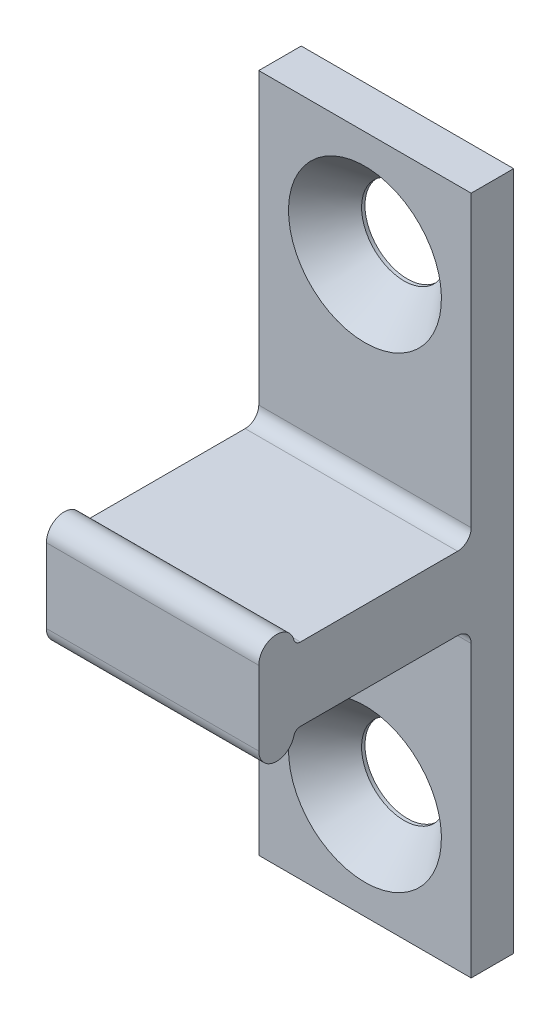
ISO-10303-21;
HEADER;
FILE_DESCRIPTION(('STEP AP214'),'2;1');
FILE_NAME('part.step','',(''),(''),'','','');
FILE_SCHEMA(('AUTOMOTIVE_DESIGN { 1 0 10303 214 1 1 1 1 }'));
ENDSEC;
DATA;
#1=APPLICATION_CONTEXT('core data for automotive mechanical design processes');
#2=APPLICATION_PROTOCOL_DEFINITION('international standard','automotive_design',2000,#1);
#3=PRODUCT_CONTEXT('',#1,'mechanical');
#4=PRODUCT('Part','Part','',(#3));
#5=PRODUCT_RELATED_PRODUCT_CATEGORY('part','',(#4));
#6=PRODUCT_DEFINITION_FORMATION('','',#4);
#7=PRODUCT_DEFINITION_CONTEXT('part definition',#1,'design');
#8=PRODUCT_DEFINITION('design','',#6,#7);
#9=PRODUCT_DEFINITION_SHAPE('','',#8);
#10=(LENGTH_UNIT() NAMED_UNIT(*) SI_UNIT(.MILLI.,.METRE.));
#11=(NAMED_UNIT(*) PLANE_ANGLE_UNIT() SI_UNIT($,.RADIAN.));
#12=(NAMED_UNIT(*) SI_UNIT($,.STERADIAN.) SOLID_ANGLE_UNIT());
#13=UNCERTAINTY_MEASURE_WITH_UNIT(LENGTH_MEASURE(1.E-05),#10,'distance_accuracy_value','');
#14=(GEOMETRIC_REPRESENTATION_CONTEXT(3) GLOBAL_UNCERTAINTY_ASSIGNED_CONTEXT((#13)) GLOBAL_UNIT_ASSIGNED_CONTEXT((#10,
#11,#12)) REPRESENTATION_CONTEXT('',''));
#15=CARTESIAN_POINT('',(0.,0.,0.));
#16=DIRECTION('',(0.,0.,1.));
#17=DIRECTION('',(1.,0.,0.));
#18=AXIS2_PLACEMENT_3D('',#15,#16,#17);
#19=CARTESIAN_POINT('',(3.96875,-1.87325000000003,2.0955));
#20=DIRECTION('',(-1.,0.,0.));
#21=DIRECTION('',(0.,0.,1.));
#22=AXIS2_PLACEMENT_3D('',#19,#20,#21);
#23=CYLINDRICAL_SURFACE('',#22,0.508);
#24=CARTESIAN_POINT('',(-3.96875,-1.87325000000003,2.0955));
#25=DIRECTION('',(1.,0.,0.));
#26=DIRECTION('',(0.,0.,-1.));
#27=AXIS2_PLACEMENT_3D('',#24,#25,#26);
#28=CIRCLE('',#27,0.508);
#29=CARTESIAN_POINT('',(-3.96875,-1.36525000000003,2.0955));
#30=VERTEX_POINT('',#29);
#31=CARTESIAN_POINT('',(-3.96875,-1.87325000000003,1.5875));
#32=VERTEX_POINT('',#31);
#33=EDGE_CURVE('E166',#30,#32,#28,.F.);
#34=ORIENTED_EDGE('',*,*,#33,.T.);
#35=DIRECTION('',(-1.,0.,0.));
#36=VECTOR('',#35,1.);
#37=CARTESIAN_POINT('',(3.96875,-1.87325000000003,1.5875));
#38=LINE('',#37,#36);
#39=CARTESIAN_POINT('',(3.96875,-1.87325000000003,1.5875));
#40=VERTEX_POINT('',#39);
#41=EDGE_CURVE('E11',#40,#32,#38,.T.);
#42=ORIENTED_EDGE('',*,*,#41,.F.);
#43=CARTESIAN_POINT('',(3.96875,-1.87325000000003,2.0955));
#44=DIRECTION('',(1.,0.,0.));
#45=DIRECTION('',(0.,0.,-1.));
#46=AXIS2_PLACEMENT_3D('',#43,#44,#45);
#47=CIRCLE('',#46,0.508);
#48=CARTESIAN_POINT('',(3.96875,-1.36525000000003,2.0955));
#49=VERTEX_POINT('',#48);
#50=EDGE_CURVE('E201',#49,#40,#47,.F.);
#51=ORIENTED_EDGE('',*,*,#50,.F.);
#52=DIRECTION('',(-1.,0.,0.));
#53=VECTOR('',#52,1.);
#54=CARTESIAN_POINT('',(3.96875,-1.36525000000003,2.0955));
#55=LINE('',#54,#53);
#56=EDGE_CURVE('E50',#49,#30,#55,.T.);
#57=ORIENTED_EDGE('',*,*,#56,.T.);
#58=EDGE_LOOP('',(#34,#42,#51,#57));
#59=FACE_BOUND('',#58,.T.);
#60=ADVANCED_FACE('F34',(#59),#23,.F.);
#61=CARTESIAN_POINT('',(3.96875,0.,1.5875));
#62=DIRECTION('',(0.,0.,-1.));
#63=DIRECTION('',(0.,1.,0.));
#64=AXIS2_PLACEMENT_3D('',#61,#62,#63);
#65=PLANE('',#64);
#66=CARTESIAN_POINT('',(0.,-8.73124999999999,1.58749999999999));
#67=DIRECTION('',(0.,0.,1.));
#68=DIRECTION('',(0.,-1.,0.));
#69=AXIS2_PLACEMENT_3D('',#66,#67,#68);
#70=CIRCLE('',#69,2.8575);
#71=CARTESIAN_POINT('',(0.,-11.58875,1.58749999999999));
#72=VERTEX_POINT('',#71);
#73=EDGE_CURVE('E291',#72,#72,#70,.T.);
#74=ORIENTED_EDGE('',*,*,#73,.F.);
#75=EDGE_LOOP('',(#74));
#76=FACE_BOUND('',#75,.T.);
#77=DIRECTION('',(0.,-1.,0.));
#78=VECTOR('',#77,1.);
#79=CARTESIAN_POINT('',(-3.96875,0.,1.5875));
#80=LINE('',#79,#78);
#81=CARTESIAN_POINT('',(-3.96875,-12.7,1.58749999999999));
#82=VERTEX_POINT('',#81);
#83=EDGE_CURVE('E168',#32,#82,#80,.T.);
#84=ORIENTED_EDGE('',*,*,#83,.T.);
#85=DIRECTION('',(-1.,0.,0.));
#86=VECTOR('',#85,1.);
#87=CARTESIAN_POINT('',(3.96875,-12.7,1.58749999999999));
#88=LINE('',#87,#86);
#89=CARTESIAN_POINT('',(3.96875,-12.7,1.58749999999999));
#90=VERTEX_POINT('',#89);
#91=EDGE_CURVE('E42',#90,#82,#88,.T.);
#92=ORIENTED_EDGE('',*,*,#91,.F.);
#93=DIRECTION('',(0.,-1.,0.));
#94=VECTOR('',#93,1.);
#95=CARTESIAN_POINT('',(3.96875,0.,1.5875));
#96=LINE('',#95,#94);
#97=EDGE_CURVE('E106',#40,#90,#96,.T.);
#98=ORIENTED_EDGE('',*,*,#97,.F.);
#99=ORIENTED_EDGE('',*,*,#41,.T.);
#100=EDGE_LOOP('',(#84,#92,#98,#99));
#101=FACE_BOUND('',#100,.T.);
#102=ADVANCED_FACE('F230',(#76,#101),#65,.F.);
#103=CARTESIAN_POINT('',(3.96875,-12.7,0.));
#104=DIRECTION('',(0.,-1.,0.));
#105=DIRECTION('',(0.,0.,-1.));
#106=AXIS2_PLACEMENT_3D('',#103,#104,#105);
#107=PLANE('',#106);
#108=DIRECTION('',(0.,0.,1.));
#109=VECTOR('',#108,1.);
#110=CARTESIAN_POINT('',(-3.96875,-12.7,0.));
#111=LINE('',#110,#109);
#112=CARTESIAN_POINT('',(-3.96875,-12.7,0.));
#113=VERTEX_POINT('',#112);
#114=EDGE_CURVE('E172',#113,#82,#111,.T.);
#115=ORIENTED_EDGE('',*,*,#114,.F.);
#116=DIRECTION('',(-1.,0.,0.));
#117=VECTOR('',#116,1.);
#118=CARTESIAN_POINT('',(3.96875,-12.7,0.));
#119=LINE('',#118,#117);
#120=CARTESIAN_POINT('',(3.96875,-12.7,0.));
#121=VERTEX_POINT('',#120);
#122=EDGE_CURVE('E223',#121,#113,#119,.T.);
#123=ORIENTED_EDGE('',*,*,#122,.F.);
#124=DIRECTION('',(0.,0.,1.));
#125=VECTOR('',#124,1.);
#126=CARTESIAN_POINT('',(3.96875,-12.7,0.));
#127=LINE('',#126,#125);
#128=EDGE_CURVE('E229',#121,#90,#127,.T.);
#129=ORIENTED_EDGE('',*,*,#128,.T.);
#130=ORIENTED_EDGE('',*,*,#91,.T.);
#131=EDGE_LOOP('',(#115,#123,#129,#130));
#132=FACE_BOUND('',#131,.T.);
#133=ADVANCED_FACE('F227',(#132),#107,.T.);
#134=CARTESIAN_POINT('',(3.96875,0.,0.));
#135=DIRECTION('',(0.,0.,-1.));
#136=DIRECTION('',(-1.,0.,0.));
#137=AXIS2_PLACEMENT_3D('',#134,#135,#136);
#138=PLANE('',#137);
#139=CARTESIAN_POINT('',(0.,8.73124999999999,0.));
#140=DIRECTION('',(0.,0.,1.));
#141=DIRECTION('',(0.,-1.,0.));
#142=AXIS2_PLACEMENT_3D('',#139,#140,#141);
#143=CIRCLE('',#142,1.5875);
#144=CARTESIAN_POINT('',(0.,7.14374999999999,0.));
#145=VERTEX_POINT('',#144);
#146=EDGE_CURVE('E294',#145,#145,#143,.T.);
#147=ORIENTED_EDGE('',*,*,#146,.T.);
#148=EDGE_LOOP('',(#147));
#149=FACE_BOUND('',#148,.T.);
#150=CARTESIAN_POINT('',(0.,-8.73124999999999,0.));
#151=DIRECTION('',(0.,0.,1.));
#152=DIRECTION('',(0.,-1.,0.));
#153=AXIS2_PLACEMENT_3D('',#150,#151,#152);
#154=CIRCLE('',#153,1.5875);
#155=CARTESIAN_POINT('',(0.,-10.31875,0.));
#156=VERTEX_POINT('',#155);
#157=EDGE_CURVE('E169',#156,#156,#154,.T.);
#158=ORIENTED_EDGE('',*,*,#157,.T.);
#159=EDGE_LOOP('',(#158));
#160=FACE_BOUND('',#159,.T.);
#161=DIRECTION('',(0.,-1.,0.));
#162=VECTOR('',#161,1.);
#163=CARTESIAN_POINT('',(-3.96875,0.,0.));
#164=LINE('',#163,#162);
#165=CARTESIAN_POINT('',(-3.96875,12.7,0.));
#166=VERTEX_POINT('',#165);
#167=EDGE_CURVE('E175',#166,#113,#164,.T.);
#168=ORIENTED_EDGE('',*,*,#167,.F.);
#169=DIRECTION('',(-1.,0.,0.));
#170=VECTOR('',#169,1.);
#171=CARTESIAN_POINT('',(3.96875,12.7,0.));
#172=LINE('',#171,#170);
#173=CARTESIAN_POINT('',(3.96875,12.7,0.));
#174=VERTEX_POINT('',#173);
#175=EDGE_CURVE('E221',#174,#166,#172,.T.);
#176=ORIENTED_EDGE('',*,*,#175,.F.);
#177=DIRECTION('',(0.,-1.,0.));
#178=VECTOR('',#177,1.);
#179=CARTESIAN_POINT('',(3.96875,0.,0.));
#180=LINE('',#179,#178);
#181=EDGE_CURVE('E242',#174,#121,#180,.T.);
#182=ORIENTED_EDGE('',*,*,#181,.T.);
#183=ORIENTED_EDGE('',*,*,#122,.T.);
#184=EDGE_LOOP('',(#168,#176,#182,#183));
#185=FACE_BOUND('',#184,.T.);
#186=ADVANCED_FACE('F238',(#149,#160,#185),#138,.T.);
#187=CARTESIAN_POINT('',(3.96875,12.7,0.));
#188=DIRECTION('',(0.,-1.,0.));
#189=DIRECTION('',(0.,0.,-1.));
#190=AXIS2_PLACEMENT_3D('',#187,#188,#189);
#191=PLANE('',#190);
#192=DIRECTION('',(0.,0.,1.));
#193=VECTOR('',#192,1.);
#194=CARTESIAN_POINT('',(-3.96875,12.7,0.));
#195=LINE('',#194,#193);
#196=CARTESIAN_POINT('',(-3.96875,12.7,1.58749999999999));
#197=VERTEX_POINT('',#196);
#198=EDGE_CURVE('E178',#166,#197,#195,.T.);
#199=ORIENTED_EDGE('',*,*,#198,.T.);
#200=DIRECTION('',(-1.,0.,0.));
#201=VECTOR('',#200,1.);
#202=CARTESIAN_POINT('',(3.96875,12.7,1.58749999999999));
#203=LINE('',#202,#201);
#204=CARTESIAN_POINT('',(3.96875,12.7,1.58749999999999));
#205=VERTEX_POINT('',#204);
#206=EDGE_CURVE('E218',#205,#197,#203,.T.);
#207=ORIENTED_EDGE('',*,*,#206,.F.);
#208=DIRECTION('',(0.,0.,1.));
#209=VECTOR('',#208,1.);
#210=CARTESIAN_POINT('',(3.96875,12.7,0.));
#211=LINE('',#210,#209);
#212=EDGE_CURVE('E244',#174,#205,#211,.T.);
#213=ORIENTED_EDGE('',*,*,#212,.F.);
#214=ORIENTED_EDGE('',*,*,#175,.T.);
#215=EDGE_LOOP('',(#199,#207,#213,#214));
#216=FACE_BOUND('',#215,.T.);
#217=ADVANCED_FACE('F310',(#216),#191,.F.);
#218=CARTESIAN_POINT('',(3.96875,0.,1.5875));
#219=DIRECTION('',(0.,0.,-1.));
#220=DIRECTION('',(0.,1.,0.));
#221=AXIS2_PLACEMENT_3D('',#218,#219,#220);
#222=PLANE('',#221);
#223=CARTESIAN_POINT('',(0.,8.73124999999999,1.58749999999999));
#224=DIRECTION('',(0.,0.,1.));
#225=DIRECTION('',(0.,-1.,0.));
#226=AXIS2_PLACEMENT_3D('',#223,#224,#225);
#227=CIRCLE('',#226,2.8575);
#228=CARTESIAN_POINT('',(0.,5.87374999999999,1.58749999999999));
#229=VERTEX_POINT('',#228);
#230=EDGE_CURVE('E300',#229,#229,#227,.T.);
#231=ORIENTED_EDGE('',*,*,#230,.F.);
#232=EDGE_LOOP('',(#231));
#233=FACE_BOUND('',#232,.T.);
#234=DIRECTION('',(0.,-1.,0.));
#235=VECTOR('',#234,1.);
#236=CARTESIAN_POINT('',(-3.96875,0.,1.5875));
#237=LINE('',#236,#235);
#238=CARTESIAN_POINT('',(-3.96875,1.87325000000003,1.5875));
#239=VERTEX_POINT('',#238);
#240=EDGE_CURVE('E180',#197,#239,#237,.T.);
#241=ORIENTED_EDGE('',*,*,#240,.T.);
#242=DIRECTION('',(-1.,0.,0.));
#243=VECTOR('',#242,1.);
#244=CARTESIAN_POINT('',(3.96875,1.87325000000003,1.5875));
#245=LINE('',#244,#243);
#246=CARTESIAN_POINT('',(3.96875,1.87325000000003,1.5875));
#247=VERTEX_POINT('',#246);
#248=EDGE_CURVE('E216',#247,#239,#245,.T.);
#249=ORIENTED_EDGE('',*,*,#248,.F.);
#250=DIRECTION('',(0.,-1.,0.));
#251=VECTOR('',#250,1.);
#252=CARTESIAN_POINT('',(3.96875,0.,1.5875));
#253=LINE('',#252,#251);
#254=EDGE_CURVE('E250',#205,#247,#253,.T.);
#255=ORIENTED_EDGE('',*,*,#254,.F.);
#256=ORIENTED_EDGE('',*,*,#206,.T.);
#257=EDGE_LOOP('',(#241,#249,#255,#256));
#258=FACE_BOUND('',#257,.T.);
#259=ADVANCED_FACE('F306',(#233,#258),#222,.F.);
#260=CARTESIAN_POINT('',(3.96875,1.87325000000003,2.0955));
#261=DIRECTION('',(-1.,0.,0.));
#262=DIRECTION('',(0.,0.,1.));
#263=AXIS2_PLACEMENT_3D('',#260,#261,#262);
#264=CYLINDRICAL_SURFACE('',#263,0.508);
#265=CARTESIAN_POINT('',(-3.96875,1.87325000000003,2.0955));
#266=DIRECTION('',(1.,0.,0.));
#267=DIRECTION('',(0.,0.,-1.));
#268=AXIS2_PLACEMENT_3D('',#265,#266,#267);
#269=CIRCLE('',#268,0.508);
#270=CARTESIAN_POINT('',(-3.96875,1.36525000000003,2.0955));
#271=VERTEX_POINT('',#270);
#272=EDGE_CURVE('E183',#271,#239,#269,.T.);
#273=ORIENTED_EDGE('',*,*,#272,.F.);
#274=DIRECTION('',(-1.,0.,0.));
#275=VECTOR('',#274,1.);
#276=CARTESIAN_POINT('',(3.96875,1.36525000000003,2.0955));
#277=LINE('',#276,#275);
#278=CARTESIAN_POINT('',(3.96875,1.36525000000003,2.0955));
#279=VERTEX_POINT('',#278);
#280=EDGE_CURVE('E214',#279,#271,#277,.T.);
#281=ORIENTED_EDGE('',*,*,#280,.F.);
#282=CARTESIAN_POINT('',(3.96875,1.87325000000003,2.0955));
#283=DIRECTION('',(1.,0.,0.));
#284=DIRECTION('',(0.,0.,-1.));
#285=AXIS2_PLACEMENT_3D('',#282,#283,#284);
#286=CIRCLE('',#285,0.508);
#287=EDGE_CURVE('E252',#279,#247,#286,.T.);
#288=ORIENTED_EDGE('',*,*,#287,.T.);
#289=ORIENTED_EDGE('',*,*,#248,.T.);
#290=EDGE_LOOP('',(#273,#281,#288,#289));
#291=FACE_BOUND('',#290,.T.);
#292=ADVANCED_FACE('F309',(#291),#264,.F.);
#293=CARTESIAN_POINT('',(3.96875,1.36525000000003,0.));
#294=DIRECTION('',(0.,-1.,0.));
#295=DIRECTION('',(0.,0.,-1.));
#296=AXIS2_PLACEMENT_3D('',#293,#294,#295);
#297=PLANE('',#296);
#298=DIRECTION('',(0.,0.,1.));
#299=VECTOR('',#298,1.);
#300=CARTESIAN_POINT('',(-3.96875,1.36525000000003,0.));
#301=LINE('',#300,#299);
#302=CARTESIAN_POINT('',(-3.96875,1.36525000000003,7.96697325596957));
#303=VERTEX_POINT('',#302);
#304=EDGE_CURVE('E186',#271,#303,#301,.T.);
#305=ORIENTED_EDGE('',*,*,#304,.T.);
#306=DIRECTION('',(-1.,0.,0.));
#307=VECTOR('',#306,1.);
#308=CARTESIAN_POINT('',(3.96875,1.36525000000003,7.96697325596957));
#309=LINE('',#308,#307);
#310=CARTESIAN_POINT('',(3.96875,1.36525000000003,7.96697325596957));
#311=VERTEX_POINT('',#310);
#312=EDGE_CURVE('E211',#311,#303,#309,.T.);
#313=ORIENTED_EDGE('',*,*,#312,.F.);
#314=DIRECTION('',(0.,0.,1.));
#315=VECTOR('',#314,1.);
#316=CARTESIAN_POINT('',(3.96875,1.36525000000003,0.));
#317=LINE('',#316,#315);
#318=EDGE_CURVE('E255',#279,#311,#317,.T.);
#319=ORIENTED_EDGE('',*,*,#318,.F.);
#320=ORIENTED_EDGE('',*,*,#280,.T.);
#321=EDGE_LOOP('',(#305,#313,#319,#320));
#322=FACE_BOUND('',#321,.T.);
#323=ADVANCED_FACE('F449',(#322),#297,.F.);
#324=CARTESIAN_POINT('',(3.96875,1.61925000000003,7.96697325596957));
#325=DIRECTION('',(-1.,0.,0.));
#326=DIRECTION('',(0.,0.,1.));
#327=AXIS2_PLACEMENT_3D('',#324,#325,#326);
#328=CYLINDRICAL_SURFACE('',#327,0.254);
#329=CARTESIAN_POINT('',(-3.96875,1.61925000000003,7.96697325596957));
#330=DIRECTION('',(1.,0.,0.));
#331=DIRECTION('',(0.,0.,-1.));
#332=AXIS2_PLACEMENT_3D('',#329,#330,#331);
#333=CIRCLE('',#332,0.254);
#334=CARTESIAN_POINT('',(-3.96875,1.55535463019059,8.2128052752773));
#335=VERTEX_POINT('',#334);
#336=EDGE_CURVE('E188',#303,#335,#333,.F.);
#337=ORIENTED_EDGE('',*,*,#336,.T.);
#338=DIRECTION('',(-1.,0.,0.));
#339=VECTOR('',#338,1.);
#340=CARTESIAN_POINT('',(3.96875,1.55535463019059,8.2128052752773));
#341=LINE('',#340,#339);
#342=CARTESIAN_POINT('',(3.96875,1.55535463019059,8.2128052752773));
#343=VERTEX_POINT('',#342);
#344=EDGE_CURVE('E208',#343,#335,#341,.T.);
#345=ORIENTED_EDGE('',*,*,#344,.F.);
#346=CARTESIAN_POINT('',(3.96875,1.61925000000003,7.96697325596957));
#347=DIRECTION('',(1.,0.,0.));
#348=DIRECTION('',(0.,0.,-1.));
#349=AXIS2_PLACEMENT_3D('',#346,#347,#348);
#350=CIRCLE('',#349,0.254);
#351=EDGE_CURVE('E257',#311,#343,#350,.F.);
#352=ORIENTED_EDGE('',*,*,#351,.F.);
#353=ORIENTED_EDGE('',*,*,#312,.T.);
#354=EDGE_LOOP('',(#337,#345,#352,#353));
#355=FACE_BOUND('',#354,.T.);
#356=ADVANCED_FACE('F440',(#355),#328,.F.);
#357=CARTESIAN_POINT('',(3.96875,1.38761194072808,8.85818105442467));
#358=DIRECTION('',(-1.,0.,0.));
#359=DIRECTION('',(0.,0.,1.));
#360=AXIS2_PLACEMENT_3D('',#357,#358,#359);
#361=CYLINDRICAL_SURFACE('',#360,0.66681894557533);
#362=CARTESIAN_POINT('',(-3.96875,1.38761194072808,8.85818105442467));
#363=DIRECTION('',(1.,0.,0.));
#364=DIRECTION('',(0.,0.,-1.));
#365=AXIS2_PLACEMENT_3D('',#362,#363,#364);
#366=CIRCLE('',#365,0.66681894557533);
#367=CARTESIAN_POINT('',(-3.96875,1.38761194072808,9.525));
#368=VERTEX_POINT('',#367);
#369=EDGE_CURVE('E190',#335,#368,#366,.T.);
#370=ORIENTED_EDGE('',*,*,#369,.T.);
#371=DIRECTION('',(-1.,0.,0.));
#372=VECTOR('',#371,1.);
#373=CARTESIAN_POINT('',(3.96875,1.38761194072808,9.525));
#374=LINE('',#373,#372);
#375=CARTESIAN_POINT('',(3.96875,1.38761194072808,9.525));
#376=VERTEX_POINT('',#375);
#377=EDGE_CURVE('E205',#376,#368,#374,.T.);
#378=ORIENTED_EDGE('',*,*,#377,.F.);
#379=CARTESIAN_POINT('',(3.96875,1.38761194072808,8.85818105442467));
#380=DIRECTION('',(1.,0.,0.));
#381=DIRECTION('',(0.,0.,-1.));
#382=AXIS2_PLACEMENT_3D('',#379,#380,#381);
#383=CIRCLE('',#382,0.66681894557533);
#384=EDGE_CURVE('E259',#343,#376,#383,.T.);
#385=ORIENTED_EDGE('',*,*,#384,.F.);
#386=ORIENTED_EDGE('',*,*,#344,.T.);
#387=EDGE_LOOP('',(#370,#378,#385,#386));
#388=FACE_BOUND('',#387,.T.);
#389=ADVANCED_FACE('F265',(#388),#361,.T.);
#390=CARTESIAN_POINT('',(3.96875,0.,9.525));
#391=DIRECTION('',(0.,0.,-1.));
#392=DIRECTION('',(-1.,0.,0.));
#393=AXIS2_PLACEMENT_3D('',#390,#391,#392);
#394=PLANE('',#393);
#395=DIRECTION('',(0.,-1.,0.));
#396=VECTOR('',#395,1.);
#397=CARTESIAN_POINT('',(-3.96875,0.,9.525));
#398=LINE('',#397,#396);
#399=CARTESIAN_POINT('',(-3.96875,-1.38761194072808,9.525));
#400=VERTEX_POINT('',#399);
#401=EDGE_CURVE('E192',#368,#400,#398,.T.);
#402=ORIENTED_EDGE('',*,*,#401,.T.);
#403=DIRECTION('',(-1.,0.,0.));
#404=VECTOR('',#403,1.);
#405=CARTESIAN_POINT('',(3.96875,-1.38761194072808,9.525));
#406=LINE('',#405,#404);
#407=CARTESIAN_POINT('',(3.96875,-1.38761194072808,9.525));
#408=VERTEX_POINT('',#407);
#409=EDGE_CURVE('E149',#408,#400,#406,.T.);
#410=ORIENTED_EDGE('',*,*,#409,.F.);
#411=DIRECTION('',(0.,-1.,0.));
#412=VECTOR('',#411,1.);
#413=CARTESIAN_POINT('',(3.96875,0.,9.525));
#414=LINE('',#413,#412);
#415=EDGE_CURVE('E157',#376,#408,#414,.T.);
#416=ORIENTED_EDGE('',*,*,#415,.F.);
#417=ORIENTED_EDGE('',*,*,#377,.T.);
#418=EDGE_LOOP('',(#402,#410,#416,#417));
#419=FACE_BOUND('',#418,.T.);
#420=ADVANCED_FACE('F269',(#419),#394,.F.);
#421=CARTESIAN_POINT('',(3.96875,-1.38761194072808,8.85818105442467));
#422=DIRECTION('',(-1.,0.,0.));
#423=DIRECTION('',(0.,0.,1.));
#424=AXIS2_PLACEMENT_3D('',#421,#422,#423);
#425=CYLINDRICAL_SURFACE('',#424,0.66681894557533);
#426=CARTESIAN_POINT('',(-3.96875,-1.38761194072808,8.85818105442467));
#427=DIRECTION('',(1.,0.,0.));
#428=DIRECTION('',(0.,0.,-1.));
#429=AXIS2_PLACEMENT_3D('',#426,#427,#428);
#430=CIRCLE('',#429,0.66681894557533);
#431=CARTESIAN_POINT('',(-3.96875,-1.55535463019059,8.2128052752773));
#432=VERTEX_POINT('',#431);
#433=EDGE_CURVE('E145',#432,#400,#430,.F.);
#434=ORIENTED_EDGE('',*,*,#433,.F.);
#435=DIRECTION('',(-1.,0.,0.));
#436=VECTOR('',#435,1.);
#437=CARTESIAN_POINT('',(3.96875,-1.55535463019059,8.2128052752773));
#438=LINE('',#437,#436);
#439=CARTESIAN_POINT('',(3.96875,-1.55535463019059,8.2128052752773));
#440=VERTEX_POINT('',#439);
#441=EDGE_CURVE('E140',#440,#432,#438,.T.);
#442=ORIENTED_EDGE('',*,*,#441,.F.);
#443=CARTESIAN_POINT('',(3.96875,-1.38761194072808,8.85818105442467));
#444=DIRECTION('',(1.,0.,0.));
#445=DIRECTION('',(0.,0.,-1.));
#446=AXIS2_PLACEMENT_3D('',#443,#444,#445);
#447=CIRCLE('',#446,0.66681894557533);
#448=EDGE_CURVE('E143',#440,#408,#447,.F.);
#449=ORIENTED_EDGE('',*,*,#448,.T.);
#450=ORIENTED_EDGE('',*,*,#409,.T.);
#451=EDGE_LOOP('',(#434,#442,#449,#450));
#452=FACE_BOUND('',#451,.T.);
#453=ADVANCED_FACE('F142',(#452),#425,.T.);
#454=CARTESIAN_POINT('',(3.96875,-1.61925000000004,7.96697325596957));
#455=DIRECTION('',(-1.,0.,0.));
#456=DIRECTION('',(0.,0.,1.));
#457=AXIS2_PLACEMENT_3D('',#454,#455,#456);
#458=CYLINDRICAL_SURFACE('',#457,0.254);
#459=CARTESIAN_POINT('',(-3.96875,-1.61925000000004,7.96697325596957));
#460=DIRECTION('',(1.,0.,0.));
#461=DIRECTION('',(0.,0.,-1.));
#462=AXIS2_PLACEMENT_3D('',#459,#460,#461);
#463=CIRCLE('',#462,0.254);
#464=CARTESIAN_POINT('',(-3.96875,-1.36525000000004,7.96697325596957));
#465=VERTEX_POINT('',#464);
#466=EDGE_CURVE('E196',#465,#432,#463,.T.);
#467=ORIENTED_EDGE('',*,*,#466,.F.);
#468=DIRECTION('',(-1.,0.,0.));
#469=VECTOR('',#468,1.);
#470=CARTESIAN_POINT('',(3.96875,-1.36525000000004,7.96697325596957));
#471=LINE('',#470,#469);
#472=CARTESIAN_POINT('',(3.96875,-1.36525000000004,7.96697325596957));
#473=VERTEX_POINT('',#472);
#474=EDGE_CURVE('E94',#473,#465,#471,.T.);
#475=ORIENTED_EDGE('',*,*,#474,.F.);
#476=CARTESIAN_POINT('',(3.96875,-1.61925000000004,7.96697325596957));
#477=DIRECTION('',(1.,0.,0.));
#478=DIRECTION('',(0.,0.,-1.));
#479=AXIS2_PLACEMENT_3D('',#476,#477,#478);
#480=CIRCLE('',#479,0.254);
#481=EDGE_CURVE('E155',#473,#440,#480,.T.);
#482=ORIENTED_EDGE('',*,*,#481,.T.);
#483=ORIENTED_EDGE('',*,*,#441,.T.);
#484=EDGE_LOOP('',(#467,#475,#482,#483));
#485=FACE_BOUND('',#484,.T.);
#486=ADVANCED_FACE('F160',(#485),#458,.F.);
#487=CARTESIAN_POINT('',(3.96875,-1.36525000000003,0.));
#488=DIRECTION('',(0.,-1.,0.));
#489=DIRECTION('',(0.,0.,-1.));
#490=AXIS2_PLACEMENT_3D('',#487,#488,#489);
#491=PLANE('',#490);
#492=DIRECTION('',(0.,0.,1.));
#493=VECTOR('',#492,1.);
#494=CARTESIAN_POINT('',(-3.96875,-1.36525000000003,0.));
#495=LINE('',#494,#493);
#496=EDGE_CURVE('E198',#30,#465,#495,.T.);
#497=ORIENTED_EDGE('',*,*,#496,.F.);
#498=ORIENTED_EDGE('',*,*,#56,.F.);
#499=DIRECTION('',(0.,0.,1.));
#500=VECTOR('',#499,1.);
#501=CARTESIAN_POINT('',(3.96875,-1.36525000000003,0.));
#502=LINE('',#501,#500);
#503=EDGE_CURVE('E161',#49,#473,#502,.T.);
#504=ORIENTED_EDGE('',*,*,#503,.T.);
#505=ORIENTED_EDGE('',*,*,#474,.T.);
#506=EDGE_LOOP('',(#497,#498,#504,#505));
#507=FACE_BOUND('',#506,.T.);
#508=ADVANCED_FACE('F270',(#507),#491,.T.);
#509=CARTESIAN_POINT('',(3.96875,0.,0.));
#510=DIRECTION('',(1.,0.,0.));
#511=DIRECTION('',(0.,0.,-1.));
#512=AXIS2_PLACEMENT_3D('',#509,#510,#511);
#513=PLANE('',#512);
#514=ORIENTED_EDGE('',*,*,#50,.T.);
#515=ORIENTED_EDGE('',*,*,#97,.T.);
#516=ORIENTED_EDGE('',*,*,#128,.F.);
#517=ORIENTED_EDGE('',*,*,#181,.F.);
#518=ORIENTED_EDGE('',*,*,#212,.T.);
#519=ORIENTED_EDGE('',*,*,#254,.T.);
#520=ORIENTED_EDGE('',*,*,#287,.F.);
#521=ORIENTED_EDGE('',*,*,#318,.T.);
#522=ORIENTED_EDGE('',*,*,#351,.T.);
#523=ORIENTED_EDGE('',*,*,#384,.T.);
#524=ORIENTED_EDGE('',*,*,#415,.T.);
#525=ORIENTED_EDGE('',*,*,#448,.F.);
#526=ORIENTED_EDGE('',*,*,#481,.F.);
#527=ORIENTED_EDGE('',*,*,#503,.F.);
#528=EDGE_LOOP('',(#514,#515,#516,#517,#518,#519,#520,#521,#522,#523,#524,#525,#526,#527));
#529=FACE_BOUND('',#528,.T.);
#530=ADVANCED_FACE('F153',(#529),#513,.T.);
#531=CARTESIAN_POINT('',(-3.96875,0.,0.));
#532=DIRECTION('',(1.,0.,0.));
#533=DIRECTION('',(0.,0.,-1.));
#534=AXIS2_PLACEMENT_3D('',#531,#532,#533);
#535=PLANE('',#534);
#536=ORIENTED_EDGE('',*,*,#33,.F.);
#537=ORIENTED_EDGE('',*,*,#496,.T.);
#538=ORIENTED_EDGE('',*,*,#466,.T.);
#539=ORIENTED_EDGE('',*,*,#433,.T.);
#540=ORIENTED_EDGE('',*,*,#401,.F.);
#541=ORIENTED_EDGE('',*,*,#369,.F.);
#542=ORIENTED_EDGE('',*,*,#336,.F.);
#543=ORIENTED_EDGE('',*,*,#304,.F.);
#544=ORIENTED_EDGE('',*,*,#272,.T.);
#545=ORIENTED_EDGE('',*,*,#240,.F.);
#546=ORIENTED_EDGE('',*,*,#198,.F.);
#547=ORIENTED_EDGE('',*,*,#167,.T.);
#548=ORIENTED_EDGE('',*,*,#114,.T.);
#549=ORIENTED_EDGE('',*,*,#83,.F.);
#550=EDGE_LOOP('',(#536,#537,#538,#539,#540,#541,#542,#543,#544,#545,#546,#547,#548,#549));
#551=FACE_BOUND('',#550,.T.);
#552=ADVANCED_FACE('F233',(#551),#535,.F.);
#553=CARTESIAN_POINT('',(0.,-8.73124999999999,1.58749999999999));
#554=DIRECTION('',(0.,0.,1.));
#555=DIRECTION('',(0.,-1.,0.));
#556=AXIS2_PLACEMENT_3D('',#553,#554,#555);
#557=CYLINDRICAL_SURFACE('',#556,1.5875);
#558=ORIENTED_EDGE('',*,*,#157,.F.);
#559=EDGE_LOOP('',(#558));
#560=FACE_BOUND('',#559,.T.);
#561=CARTESIAN_POINT('',(0.,-8.73124999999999,0.126532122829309));
#562=DIRECTION('',(0.,0.,1.));
#563=DIRECTION('',(0.,-1.,0.));
#564=AXIS2_PLACEMENT_3D('',#561,#562,#563);
#565=CIRCLE('',#564,1.5875);
#566=CARTESIAN_POINT('',(0.,-10.31875,0.126532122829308));
#567=VERTEX_POINT('',#566);
#568=EDGE_CURVE('E288',#567,#567,#565,.T.);
#569=ORIENTED_EDGE('',*,*,#568,.T.);
#570=EDGE_LOOP('',(#569));
#571=FACE_BOUND('',#570,.T.);
#572=ADVANCED_FACE('F358',(#560,#571),#557,.F.);
#573=CARTESIAN_POINT('',(0.,-8.73124999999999,1.58749999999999));
#574=DIRECTION('',(0.,0.,1.));
#575=DIRECTION('',(0.,-1.,0.));
#576=AXIS2_PLACEMENT_3D('',#573,#574,#575);
#577=CONICAL_SURFACE('',#576,2.8575,0.715584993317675);
#578=ORIENTED_EDGE('',*,*,#568,.F.);
#579=EDGE_LOOP('',(#578));
#580=FACE_BOUND('',#579,.T.);
#581=ORIENTED_EDGE('',*,*,#73,.T.);
#582=EDGE_LOOP('',(#581));
#583=FACE_BOUND('',#582,.T.);
#584=ADVANCED_FACE('F363',(#580,#583),#577,.F.);
#585=CARTESIAN_POINT('',(0.,8.73124999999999,1.58749999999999));
#586=DIRECTION('',(0.,0.,1.));
#587=DIRECTION('',(0.,-1.,0.));
#588=AXIS2_PLACEMENT_3D('',#585,#586,#587);
#589=CYLINDRICAL_SURFACE('',#588,1.5875);
#590=ORIENTED_EDGE('',*,*,#146,.F.);
#591=EDGE_LOOP('',(#590));
#592=FACE_BOUND('',#591,.T.);
#593=CARTESIAN_POINT('',(0.,8.73124999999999,0.126532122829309));
#594=DIRECTION('',(0.,0.,1.));
#595=DIRECTION('',(0.,-1.,0.));
#596=AXIS2_PLACEMENT_3D('',#593,#594,#595);
#597=CIRCLE('',#596,1.5875);
#598=CARTESIAN_POINT('',(0.,7.14374999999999,0.12653212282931));
#599=VERTEX_POINT('',#598);
#600=EDGE_CURVE('E297',#599,#599,#597,.T.);
#601=ORIENTED_EDGE('',*,*,#600,.T.);
#602=EDGE_LOOP('',(#601));
#603=FACE_BOUND('',#602,.T.);
#604=ADVANCED_FACE('F375',(#592,#603),#589,.F.);
#605=CARTESIAN_POINT('',(0.,8.73124999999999,1.58749999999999));
#606=DIRECTION('',(0.,0.,1.));
#607=DIRECTION('',(0.,-1.,0.));
#608=AXIS2_PLACEMENT_3D('',#605,#606,#607);
#609=CONICAL_SURFACE('',#608,2.8575,0.715584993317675);
#610=ORIENTED_EDGE('',*,*,#600,.F.);
#611=EDGE_LOOP('',(#610));
#612=FACE_BOUND('',#611,.T.);
#613=ORIENTED_EDGE('',*,*,#230,.T.);
#614=EDGE_LOOP('',(#613));
#615=FACE_BOUND('',#614,.T.);
#616=ADVANCED_FACE('F304',(#612,#615),#609,.F.);
#617=CLOSED_SHELL('',(#60,#102,#133,#186,#217,#259,#292,#323,#356,#389,#420,#453,#486,#508,#530,
#552,#572,#584,#604,#616));
#618=MANIFOLD_SOLID_BREP('B2',#617);
#619=ADVANCED_BREP_SHAPE_REPRESENTATION('',(#18,#618),#14);
#620=SHAPE_DEFINITION_REPRESENTATION(#9,#619);
ENDSEC;
END-ISO-10303-21;
